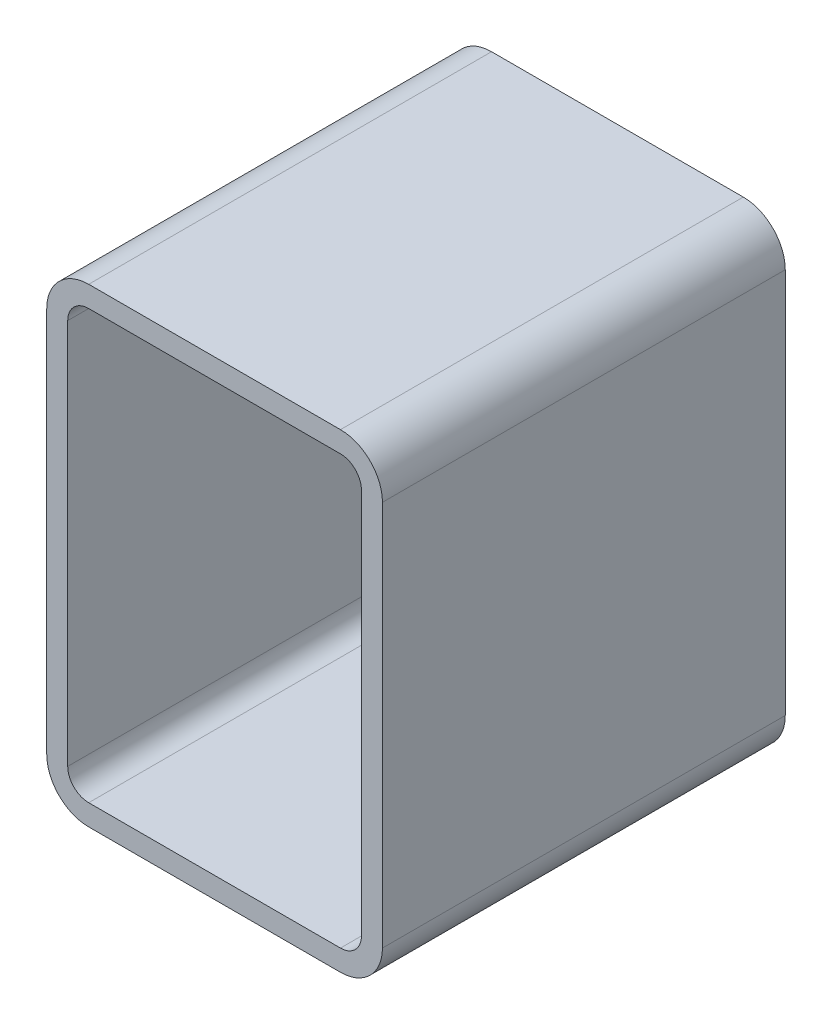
ISO-10303-21;
HEADER;
FILE_DESCRIPTION(('STEP AP214'),'2;1');
FILE_NAME('part.step','',(''),(''),'','','');
FILE_SCHEMA(('AUTOMOTIVE_DESIGN { 1 0 10303 214 1 1 1 1 }'));
ENDSEC;
DATA;
#1=APPLICATION_CONTEXT('core data for automotive mechanical design processes');
#2=APPLICATION_PROTOCOL_DEFINITION('international standard','automotive_design',2000,#1);
#3=PRODUCT_CONTEXT('',#1,'mechanical');
#4=PRODUCT('Part','Part','',(#3));
#5=PRODUCT_RELATED_PRODUCT_CATEGORY('part','',(#4));
#6=PRODUCT_DEFINITION_FORMATION('','',#4);
#7=PRODUCT_DEFINITION_CONTEXT('part definition',#1,'design');
#8=PRODUCT_DEFINITION('design','',#6,#7);
#9=PRODUCT_DEFINITION_SHAPE('','',#8);
#10=(LENGTH_UNIT() NAMED_UNIT(*) SI_UNIT(.MILLI.,.METRE.));
#11=(NAMED_UNIT(*) PLANE_ANGLE_UNIT() SI_UNIT($,.RADIAN.));
#12=(NAMED_UNIT(*) SI_UNIT($,.STERADIAN.) SOLID_ANGLE_UNIT());
#13=UNCERTAINTY_MEASURE_WITH_UNIT(LENGTH_MEASURE(1.E-05),#10,'distance_accuracy_value','');
#14=(GEOMETRIC_REPRESENTATION_CONTEXT(3) GLOBAL_UNCERTAINTY_ASSIGNED_CONTEXT((#13)) GLOBAL_UNIT_ASSIGNED_CONTEXT((#10,
#11,#12)) REPRESENTATION_CONTEXT('',''));
#15=CARTESIAN_POINT('',(0.,0.,0.));
#16=DIRECTION('',(0.,0.,1.));
#17=DIRECTION('',(1.,0.,0.));
#18=AXIS2_PLACEMENT_3D('',#15,#16,#17);
#19=CARTESIAN_POINT('',(34.4845794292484,325.678679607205,304.8));
#20=DIRECTION('',(0.,0.,1.));
#21=DIRECTION('',(1.,0.,0.));
#22=AXIS2_PLACEMENT_3D('',#19,#20,#21);
#23=PLANE('',#22);
#24=CARTESIAN_POINT('',(34.4845794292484,325.678679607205,304.8));
#25=DIRECTION('',(0.,0.,1.));
#26=DIRECTION('',(1.,0.,0.));
#27=AXIS2_PLACEMENT_3D('',#24,#25,#26);
#28=CIRCLE('',#27,31.75);
#29=CARTESIAN_POINT('',(34.4845794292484,357.428679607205,304.8));
#30=VERTEX_POINT('',#29);
#31=CARTESIAN_POINT('',(2.73457942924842,325.678679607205,304.8));
#32=VERTEX_POINT('',#31);
#33=EDGE_CURVE('E211',#30,#32,#28,.T.);
#34=ORIENTED_EDGE('',*,*,#33,.T.);
#35=DIRECTION('',(0.,-1.,0.));
#36=VECTOR('',#35,1.);
#37=CARTESIAN_POINT('',(2.73457942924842,33.5786796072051,304.8));
#38=LINE('',#37,#36);
#39=CARTESIAN_POINT('',(2.73457942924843,33.5786796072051,304.8));
#40=VERTEX_POINT('',#39);
#41=EDGE_CURVE('E214',#32,#40,#38,.T.);
#42=ORIENTED_EDGE('',*,*,#41,.T.);
#43=CARTESIAN_POINT('',(34.4845794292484,33.5786796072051,304.8));
#44=DIRECTION('',(0.,0.,1.));
#45=DIRECTION('',(1.,0.,0.));
#46=AXIS2_PLACEMENT_3D('',#43,#44,#45);
#47=CIRCLE('',#46,31.75);
#48=CARTESIAN_POINT('',(34.4845794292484,1.82867960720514,304.8));
#49=VERTEX_POINT('',#48);
#50=EDGE_CURVE('E217',#40,#49,#47,.T.);
#51=ORIENTED_EDGE('',*,*,#50,.T.);
#52=DIRECTION('',(1.,0.,0.));
#53=VECTOR('',#52,1.);
#54=CARTESIAN_POINT('',(224.984579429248,1.82867960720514,304.8));
#55=LINE('',#54,#53);
#56=CARTESIAN_POINT('',(224.984579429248,1.82867960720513,304.8));
#57=VERTEX_POINT('',#56);
#58=EDGE_CURVE('E219',#49,#57,#55,.T.);
#59=ORIENTED_EDGE('',*,*,#58,.T.);
#60=CARTESIAN_POINT('',(224.984579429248,33.5786796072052,304.8));
#61=DIRECTION('',(0.,0.,1.));
#62=DIRECTION('',(1.,0.,0.));
#63=AXIS2_PLACEMENT_3D('',#60,#61,#62);
#64=CIRCLE('',#63,31.75);
#65=CARTESIAN_POINT('',(256.734579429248,33.5786796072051,304.8));
#66=VERTEX_POINT('',#65);
#67=EDGE_CURVE('E221',#57,#66,#64,.T.);
#68=ORIENTED_EDGE('',*,*,#67,.T.);
#69=DIRECTION('',(0.,1.,0.));
#70=VECTOR('',#69,1.);
#71=CARTESIAN_POINT('',(256.734579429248,325.678679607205,304.8));
#72=LINE('',#71,#70);
#73=CARTESIAN_POINT('',(256.734579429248,325.678679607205,304.8));
#74=VERTEX_POINT('',#73);
#75=EDGE_CURVE('E223',#66,#74,#72,.T.);
#76=ORIENTED_EDGE('',*,*,#75,.T.);
#77=CARTESIAN_POINT('',(224.984579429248,325.678679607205,304.8));
#78=DIRECTION('',(0.,0.,1.));
#79=DIRECTION('',(1.,0.,0.));
#80=AXIS2_PLACEMENT_3D('',#77,#78,#79);
#81=CIRCLE('',#80,31.75);
#82=CARTESIAN_POINT('',(224.984579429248,357.428679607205,304.8));
#83=VERTEX_POINT('',#82);
#84=EDGE_CURVE('E225',#74,#83,#81,.T.);
#85=ORIENTED_EDGE('',*,*,#84,.T.);
#86=DIRECTION('',(-1.,0.,0.));
#87=VECTOR('',#86,1.);
#88=CARTESIAN_POINT('',(34.4845794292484,357.428679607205,304.8));
#89=LINE('',#88,#87);
#90=EDGE_CURVE('E227',#83,#30,#89,.T.);
#91=ORIENTED_EDGE('',*,*,#90,.T.);
#92=EDGE_LOOP('',(#34,#42,#51,#59,#68,#76,#85,#91));
#93=FACE_BOUND('',#92,.T.);
#94=DIRECTION('',(0.,-1.,0.));
#95=VECTOR('',#94,1.);
#96=CARTESIAN_POINT('',(18.6095794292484,33.5786796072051,304.8));
#97=LINE('',#96,#95);
#98=CARTESIAN_POINT('',(18.6095794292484,325.678679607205,304.8));
#99=VERTEX_POINT('',#98);
#100=CARTESIAN_POINT('',(18.6095794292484,33.5786796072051,304.8));
#101=VERTEX_POINT('',#100);
#102=EDGE_CURVE('E154',#99,#101,#97,.T.);
#103=ORIENTED_EDGE('',*,*,#102,.F.);
#104=CARTESIAN_POINT('',(34.4845794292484,325.678679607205,304.8));
#105=DIRECTION('',(0.,0.,1.));
#106=DIRECTION('',(1.,0.,0.));
#107=AXIS2_PLACEMENT_3D('',#104,#105,#106);
#108=CIRCLE('',#107,15.875);
#109=CARTESIAN_POINT('',(34.4845794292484,341.553679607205,304.8));
#110=VERTEX_POINT('',#109);
#111=EDGE_CURVE('E146',#110,#99,#108,.T.);
#112=ORIENTED_EDGE('',*,*,#111,.F.);
#113=DIRECTION('',(-1.,0.,0.));
#114=VECTOR('',#113,1.);
#115=CARTESIAN_POINT('',(34.4845794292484,341.553679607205,304.8));
#116=LINE('',#115,#114);
#117=CARTESIAN_POINT('',(224.984579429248,341.553679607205,304.8));
#118=VERTEX_POINT('',#117);
#119=EDGE_CURVE('E179',#118,#110,#116,.T.);
#120=ORIENTED_EDGE('',*,*,#119,.F.);
#121=CARTESIAN_POINT('',(224.984579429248,325.678679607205,304.8));
#122=DIRECTION('',(0.,0.,1.));
#123=DIRECTION('',(1.,0.,0.));
#124=AXIS2_PLACEMENT_3D('',#121,#122,#123);
#125=CIRCLE('',#124,15.875);
#126=CARTESIAN_POINT('',(240.859579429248,325.678679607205,304.8));
#127=VERTEX_POINT('',#126);
#128=EDGE_CURVE('E177',#127,#118,#125,.T.);
#129=ORIENTED_EDGE('',*,*,#128,.F.);
#130=DIRECTION('',(0.,1.,0.));
#131=VECTOR('',#130,1.);
#132=CARTESIAN_POINT('',(240.859579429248,325.678679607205,304.8));
#133=LINE('',#132,#131);
#134=CARTESIAN_POINT('',(240.859579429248,33.5786796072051,304.8));
#135=VERTEX_POINT('',#134);
#136=EDGE_CURVE('E175',#135,#127,#133,.T.);
#137=ORIENTED_EDGE('',*,*,#136,.F.);
#138=CARTESIAN_POINT('',(224.984579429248,33.5786796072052,304.8));
#139=DIRECTION('',(0.,0.,1.));
#140=DIRECTION('',(1.,0.,0.));
#141=AXIS2_PLACEMENT_3D('',#138,#139,#140);
#142=CIRCLE('',#141,15.875);
#143=CARTESIAN_POINT('',(224.984579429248,17.7036796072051,304.8));
#144=VERTEX_POINT('',#143);
#145=EDGE_CURVE('E173',#144,#135,#142,.T.);
#146=ORIENTED_EDGE('',*,*,#145,.F.);
#147=DIRECTION('',(1.,0.,0.));
#148=VECTOR('',#147,1.);
#149=CARTESIAN_POINT('',(224.984579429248,17.7036796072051,304.8));
#150=LINE('',#149,#148);
#151=CARTESIAN_POINT('',(34.4845794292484,17.7036796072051,304.8));
#152=VERTEX_POINT('',#151);
#153=EDGE_CURVE('E169',#152,#144,#150,.T.);
#154=ORIENTED_EDGE('',*,*,#153,.F.);
#155=CARTESIAN_POINT('',(34.4845794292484,33.5786796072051,304.8));
#156=DIRECTION('',(0.,0.,1.));
#157=DIRECTION('',(1.,0.,0.));
#158=AXIS2_PLACEMENT_3D('',#155,#156,#157);
#159=CIRCLE('',#158,15.875);
#160=EDGE_CURVE('E167',#101,#152,#159,.T.);
#161=ORIENTED_EDGE('',*,*,#160,.F.);
#162=EDGE_LOOP('',(#103,#112,#120,#129,#137,#146,#154,#161));
#163=FACE_BOUND('',#162,.T.);
#164=ADVANCED_FACE('F33',(#93,#163),#23,.T.);
#165=CARTESIAN_POINT('',(34.4845794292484,325.678679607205,0.));
#166=DIRECTION('',(0.,0.,1.));
#167=DIRECTION('',(1.,0.,0.));
#168=AXIS2_PLACEMENT_3D('',#165,#166,#167);
#169=PLANE('',#168);
#170=CARTESIAN_POINT('',(34.4845794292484,325.678679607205,0.));
#171=DIRECTION('',(0.,0.,1.));
#172=DIRECTION('',(1.,0.,0.));
#173=AXIS2_PLACEMENT_3D('',#170,#171,#172);
#174=CIRCLE('',#173,31.75);
#175=CARTESIAN_POINT('',(34.4845794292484,357.428679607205,0.));
#176=VERTEX_POINT('',#175);
#177=CARTESIAN_POINT('',(2.73457942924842,325.678679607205,0.));
#178=VERTEX_POINT('',#177);
#179=EDGE_CURVE('E162',#176,#178,#174,.T.);
#180=ORIENTED_EDGE('',*,*,#179,.F.);
#181=DIRECTION('',(-1.,0.,0.));
#182=VECTOR('',#181,1.);
#183=CARTESIAN_POINT('',(34.4845794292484,357.428679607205,0.));
#184=LINE('',#183,#182);
#185=CARTESIAN_POINT('',(224.984579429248,357.428679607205,0.));
#186=VERTEX_POINT('',#185);
#187=EDGE_CURVE('E215',#186,#176,#184,.T.);
#188=ORIENTED_EDGE('',*,*,#187,.F.);
#189=CARTESIAN_POINT('',(224.984579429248,325.678679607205,0.));
#190=DIRECTION('',(0.,0.,1.));
#191=DIRECTION('',(1.,0.,0.));
#192=AXIS2_PLACEMENT_3D('',#189,#190,#191);
#193=CIRCLE('',#192,31.75);
#194=CARTESIAN_POINT('',(256.734579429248,325.678679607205,0.));
#195=VERTEX_POINT('',#194);
#196=EDGE_CURVE('E242',#195,#186,#193,.T.);
#197=ORIENTED_EDGE('',*,*,#196,.F.);
#198=DIRECTION('',(0.,1.,0.));
#199=VECTOR('',#198,1.);
#200=CARTESIAN_POINT('',(256.734579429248,325.678679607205,0.));
#201=LINE('',#200,#199);
#202=CARTESIAN_POINT('',(256.734579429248,33.5786796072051,0.));
#203=VERTEX_POINT('',#202);
#204=EDGE_CURVE('E240',#203,#195,#201,.T.);
#205=ORIENTED_EDGE('',*,*,#204,.F.);
#206=CARTESIAN_POINT('',(224.984579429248,33.5786796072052,0.));
#207=DIRECTION('',(0.,0.,1.));
#208=DIRECTION('',(1.,0.,0.));
#209=AXIS2_PLACEMENT_3D('',#206,#207,#208);
#210=CIRCLE('',#209,31.75);
#211=CARTESIAN_POINT('',(224.984579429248,1.82867960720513,0.));
#212=VERTEX_POINT('',#211);
#213=EDGE_CURVE('E238',#212,#203,#210,.T.);
#214=ORIENTED_EDGE('',*,*,#213,.F.);
#215=DIRECTION('',(1.,0.,0.));
#216=VECTOR('',#215,1.);
#217=CARTESIAN_POINT('',(224.984579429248,1.82867960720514,0.));
#218=LINE('',#217,#216);
#219=CARTESIAN_POINT('',(34.4845794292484,1.82867960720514,0.));
#220=VERTEX_POINT('',#219);
#221=EDGE_CURVE('E236',#220,#212,#218,.T.);
#222=ORIENTED_EDGE('',*,*,#221,.F.);
#223=CARTESIAN_POINT('',(34.4845794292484,33.5786796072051,0.));
#224=DIRECTION('',(0.,0.,1.));
#225=DIRECTION('',(1.,0.,0.));
#226=AXIS2_PLACEMENT_3D('',#223,#224,#225);
#227=CIRCLE('',#226,31.75);
#228=CARTESIAN_POINT('',(2.73457942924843,33.5786796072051,0.));
#229=VERTEX_POINT('',#228);
#230=EDGE_CURVE('E234',#229,#220,#227,.T.);
#231=ORIENTED_EDGE('',*,*,#230,.F.);
#232=DIRECTION('',(0.,-1.,0.));
#233=VECTOR('',#232,1.);
#234=CARTESIAN_POINT('',(2.73457942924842,33.5786796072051,0.));
#235=LINE('',#234,#233);
#236=EDGE_CURVE('E232',#178,#229,#235,.T.);
#237=ORIENTED_EDGE('',*,*,#236,.F.);
#238=EDGE_LOOP('',(#180,#188,#197,#205,#214,#222,#231,#237));
#239=FACE_BOUND('',#238,.T.);
#240=CARTESIAN_POINT('',(34.4845794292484,325.678679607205,0.));
#241=DIRECTION('',(0.,0.,1.));
#242=DIRECTION('',(1.,0.,0.));
#243=AXIS2_PLACEMENT_3D('',#240,#241,#242);
#244=CIRCLE('',#243,15.875);
#245=CARTESIAN_POINT('',(34.4845794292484,341.553679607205,0.));
#246=VERTEX_POINT('',#245);
#247=CARTESIAN_POINT('',(18.6095794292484,325.678679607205,0.));
#248=VERTEX_POINT('',#247);
#249=EDGE_CURVE('E56',#246,#248,#244,.T.);
#250=ORIENTED_EDGE('',*,*,#249,.T.);
#251=DIRECTION('',(0.,-1.,0.));
#252=VECTOR('',#251,1.);
#253=CARTESIAN_POINT('',(18.6095794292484,33.5786796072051,0.));
#254=LINE('',#253,#252);
#255=CARTESIAN_POINT('',(18.6095794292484,33.5786796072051,0.));
#256=VERTEX_POINT('',#255);
#257=EDGE_CURVE('E161',#248,#256,#254,.T.);
#258=ORIENTED_EDGE('',*,*,#257,.T.);
#259=CARTESIAN_POINT('',(34.4845794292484,33.5786796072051,0.));
#260=DIRECTION('',(0.,0.,1.));
#261=DIRECTION('',(1.,0.,0.));
#262=AXIS2_PLACEMENT_3D('',#259,#260,#261);
#263=CIRCLE('',#262,15.875);
#264=CARTESIAN_POINT('',(34.4845794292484,17.7036796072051,0.));
#265=VERTEX_POINT('',#264);
#266=EDGE_CURVE('E183',#256,#265,#263,.T.);
#267=ORIENTED_EDGE('',*,*,#266,.T.);
#268=DIRECTION('',(1.,0.,0.));
#269=VECTOR('',#268,1.);
#270=CARTESIAN_POINT('',(224.984579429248,17.7036796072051,0.));
#271=LINE('',#270,#269);
#272=CARTESIAN_POINT('',(224.984579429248,17.7036796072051,0.));
#273=VERTEX_POINT('',#272);
#274=EDGE_CURVE('E186',#265,#273,#271,.T.);
#275=ORIENTED_EDGE('',*,*,#274,.T.);
#276=CARTESIAN_POINT('',(224.984579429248,33.5786796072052,0.));
#277=DIRECTION('',(0.,0.,1.));
#278=DIRECTION('',(1.,0.,0.));
#279=AXIS2_PLACEMENT_3D('',#276,#277,#278);
#280=CIRCLE('',#279,15.875);
#281=CARTESIAN_POINT('',(240.859579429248,33.5786796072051,0.));
#282=VERTEX_POINT('',#281);
#283=EDGE_CURVE('E189',#273,#282,#280,.T.);
#284=ORIENTED_EDGE('',*,*,#283,.T.);
#285=DIRECTION('',(0.,1.,0.));
#286=VECTOR('',#285,1.);
#287=CARTESIAN_POINT('',(240.859579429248,325.678679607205,0.));
#288=LINE('',#287,#286);
#289=CARTESIAN_POINT('',(240.859579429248,325.678679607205,0.));
#290=VERTEX_POINT('',#289);
#291=EDGE_CURVE('E192',#282,#290,#288,.T.);
#292=ORIENTED_EDGE('',*,*,#291,.T.);
#293=CARTESIAN_POINT('',(224.984579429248,325.678679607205,0.));
#294=DIRECTION('',(0.,0.,1.));
#295=DIRECTION('',(1.,0.,0.));
#296=AXIS2_PLACEMENT_3D('',#293,#294,#295);
#297=CIRCLE('',#296,15.875);
#298=CARTESIAN_POINT('',(224.984579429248,341.553679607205,0.));
#299=VERTEX_POINT('',#298);
#300=EDGE_CURVE('E195',#290,#299,#297,.T.);
#301=ORIENTED_EDGE('',*,*,#300,.T.);
#302=DIRECTION('',(-1.,0.,0.));
#303=VECTOR('',#302,1.);
#304=CARTESIAN_POINT('',(34.4845794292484,341.553679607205,0.));
#305=LINE('',#304,#303);
#306=EDGE_CURVE('E155',#299,#246,#305,.T.);
#307=ORIENTED_EDGE('',*,*,#306,.T.);
#308=EDGE_LOOP('',(#250,#258,#267,#275,#284,#292,#301,#307));
#309=FACE_BOUND('',#308,.T.);
#310=ADVANCED_FACE('F272',(#239,#309),#169,.F.);
#311=CARTESIAN_POINT('',(34.4845794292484,325.678679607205,304.8));
#312=DIRECTION('',(0.,0.,-1.));
#313=DIRECTION('',(-1.,0.,0.));
#314=AXIS2_PLACEMENT_3D('',#311,#312,#313);
#315=CYLINDRICAL_SURFACE('',#314,31.75);
#316=ORIENTED_EDGE('',*,*,#179,.T.);
#317=DIRECTION('',(0.,0.,-1.));
#318=VECTOR('',#317,1.);
#319=CARTESIAN_POINT('',(2.73457942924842,325.678679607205,304.8));
#320=LINE('',#319,#318);
#321=EDGE_CURVE('E11',#32,#178,#320,.T.);
#322=ORIENTED_EDGE('',*,*,#321,.F.);
#323=ORIENTED_EDGE('',*,*,#33,.F.);
#324=DIRECTION('',(0.,0.,-1.));
#325=VECTOR('',#324,1.);
#326=CARTESIAN_POINT('',(34.4845794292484,357.428679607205,304.8));
#327=LINE('',#326,#325);
#328=EDGE_CURVE('E229',#30,#176,#327,.T.);
#329=ORIENTED_EDGE('',*,*,#328,.T.);
#330=EDGE_LOOP('',(#316,#322,#323,#329));
#331=FACE_BOUND('',#330,.T.);
#332=ADVANCED_FACE('F35',(#331),#315,.T.);
#333=CARTESIAN_POINT('',(2.73457942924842,33.5786796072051,304.8));
#334=DIRECTION('',(1.,0.,0.));
#335=DIRECTION('',(0.,0.,-1.));
#336=AXIS2_PLACEMENT_3D('',#333,#334,#335);
#337=PLANE('',#336);
#338=ORIENTED_EDGE('',*,*,#236,.T.);
#339=DIRECTION('',(0.,0.,-1.));
#340=VECTOR('',#339,1.);
#341=CARTESIAN_POINT('',(2.73457942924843,33.5786796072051,304.8));
#342=LINE('',#341,#340);
#343=EDGE_CURVE('E41',#40,#229,#342,.T.);
#344=ORIENTED_EDGE('',*,*,#343,.F.);
#345=ORIENTED_EDGE('',*,*,#41,.F.);
#346=ORIENTED_EDGE('',*,*,#321,.T.);
#347=EDGE_LOOP('',(#338,#344,#345,#346));
#348=FACE_BOUND('',#347,.T.);
#349=ADVANCED_FACE('F289',(#348),#337,.F.);
#350=CARTESIAN_POINT('',(34.4845794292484,33.5786796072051,304.8));
#351=DIRECTION('',(0.,0.,-1.));
#352=DIRECTION('',(-1.,0.,0.));
#353=AXIS2_PLACEMENT_3D('',#350,#351,#352);
#354=CYLINDRICAL_SURFACE('',#353,31.75);
#355=ORIENTED_EDGE('',*,*,#230,.T.);
#356=DIRECTION('',(0.,0.,-1.));
#357=VECTOR('',#356,1.);
#358=CARTESIAN_POINT('',(34.4845794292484,1.82867960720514,304.8));
#359=LINE('',#358,#357);
#360=EDGE_CURVE('E259',#49,#220,#359,.T.);
#361=ORIENTED_EDGE('',*,*,#360,.F.);
#362=ORIENTED_EDGE('',*,*,#50,.F.);
#363=ORIENTED_EDGE('',*,*,#343,.T.);
#364=EDGE_LOOP('',(#355,#361,#362,#363));
#365=FACE_BOUND('',#364,.T.);
#366=ADVANCED_FACE('F266',(#365),#354,.T.);
#367=CARTESIAN_POINT('',(224.984579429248,1.82867960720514,304.8));
#368=DIRECTION('',(0.,1.,0.));
#369=DIRECTION('',(0.,0.,1.));
#370=AXIS2_PLACEMENT_3D('',#367,#368,#369);
#371=PLANE('',#370);
#372=ORIENTED_EDGE('',*,*,#221,.T.);
#373=DIRECTION('',(0.,0.,-1.));
#374=VECTOR('',#373,1.);
#375=CARTESIAN_POINT('',(224.984579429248,1.82867960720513,304.8));
#376=LINE('',#375,#374);
#377=EDGE_CURVE('E256',#57,#212,#376,.T.);
#378=ORIENTED_EDGE('',*,*,#377,.F.);
#379=ORIENTED_EDGE('',*,*,#58,.F.);
#380=ORIENTED_EDGE('',*,*,#360,.T.);
#381=EDGE_LOOP('',(#372,#378,#379,#380));
#382=FACE_BOUND('',#381,.T.);
#383=ADVANCED_FACE('F278',(#382),#371,.F.);
#384=CARTESIAN_POINT('',(224.984579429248,33.5786796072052,304.8));
#385=DIRECTION('',(0.,0.,-1.));
#386=DIRECTION('',(-1.,0.,0.));
#387=AXIS2_PLACEMENT_3D('',#384,#385,#386);
#388=CYLINDRICAL_SURFACE('',#387,31.75);
#389=ORIENTED_EDGE('',*,*,#213,.T.);
#390=DIRECTION('',(0.,0.,-1.));
#391=VECTOR('',#390,1.);
#392=CARTESIAN_POINT('',(256.734579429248,33.5786796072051,304.8));
#393=LINE('',#392,#391);
#394=EDGE_CURVE('E253',#66,#203,#393,.T.);
#395=ORIENTED_EDGE('',*,*,#394,.F.);
#396=ORIENTED_EDGE('',*,*,#67,.F.);
#397=ORIENTED_EDGE('',*,*,#377,.T.);
#398=EDGE_LOOP('',(#389,#395,#396,#397));
#399=FACE_BOUND('',#398,.T.);
#400=ADVANCED_FACE('F282',(#399),#388,.T.);
#401=CARTESIAN_POINT('',(256.734579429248,325.678679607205,304.8));
#402=DIRECTION('',(-1.,0.,0.));
#403=DIRECTION('',(0.,0.,1.));
#404=AXIS2_PLACEMENT_3D('',#401,#402,#403);
#405=PLANE('',#404);
#406=ORIENTED_EDGE('',*,*,#204,.T.);
#407=DIRECTION('',(0.,0.,-1.));
#408=VECTOR('',#407,1.);
#409=CARTESIAN_POINT('',(256.734579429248,325.678679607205,304.8));
#410=LINE('',#409,#408);
#411=EDGE_CURVE('E250',#74,#195,#410,.T.);
#412=ORIENTED_EDGE('',*,*,#411,.F.);
#413=ORIENTED_EDGE('',*,*,#75,.F.);
#414=ORIENTED_EDGE('',*,*,#394,.T.);
#415=EDGE_LOOP('',(#406,#412,#413,#414));
#416=FACE_BOUND('',#415,.T.);
#417=ADVANCED_FACE('F302',(#416),#405,.F.);
#418=CARTESIAN_POINT('',(224.984579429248,325.678679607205,304.8));
#419=DIRECTION('',(0.,0.,-1.));
#420=DIRECTION('',(-1.,0.,0.));
#421=AXIS2_PLACEMENT_3D('',#418,#419,#420);
#422=CYLINDRICAL_SURFACE('',#421,31.75);
#423=ORIENTED_EDGE('',*,*,#196,.T.);
#424=DIRECTION('',(0.,0.,-1.));
#425=VECTOR('',#424,1.);
#426=CARTESIAN_POINT('',(224.984579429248,357.428679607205,304.8));
#427=LINE('',#426,#425);
#428=EDGE_CURVE('E247',#83,#186,#427,.T.);
#429=ORIENTED_EDGE('',*,*,#428,.F.);
#430=ORIENTED_EDGE('',*,*,#84,.F.);
#431=ORIENTED_EDGE('',*,*,#411,.T.);
#432=EDGE_LOOP('',(#423,#429,#430,#431));
#433=FACE_BOUND('',#432,.T.);
#434=ADVANCED_FACE('F300',(#433),#422,.T.);
#435=CARTESIAN_POINT('',(34.4845794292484,357.428679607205,304.8));
#436=DIRECTION('',(0.,-1.,0.));
#437=DIRECTION('',(0.,0.,-1.));
#438=AXIS2_PLACEMENT_3D('',#435,#436,#437);
#439=PLANE('',#438);
#440=ORIENTED_EDGE('',*,*,#187,.T.);
#441=ORIENTED_EDGE('',*,*,#328,.F.);
#442=ORIENTED_EDGE('',*,*,#90,.F.);
#443=ORIENTED_EDGE('',*,*,#428,.T.);
#444=EDGE_LOOP('',(#440,#441,#442,#443));
#445=FACE_BOUND('',#444,.T.);
#446=ADVANCED_FACE('F295',(#445),#439,.F.);
#447=CARTESIAN_POINT('',(34.4845794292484,325.678679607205,304.8));
#448=DIRECTION('',(0.,0.,-1.));
#449=DIRECTION('',(-1.,0.,0.));
#450=AXIS2_PLACEMENT_3D('',#447,#448,#449);
#451=CYLINDRICAL_SURFACE('',#450,15.875);
#452=ORIENTED_EDGE('',*,*,#249,.F.);
#453=DIRECTION('',(0.,0.,-1.));
#454=VECTOR('',#453,1.);
#455=CARTESIAN_POINT('',(34.4845794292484,341.553679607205,304.8));
#456=LINE('',#455,#454);
#457=EDGE_CURVE('E150',#110,#246,#456,.T.);
#458=ORIENTED_EDGE('',*,*,#457,.F.);
#459=ORIENTED_EDGE('',*,*,#111,.T.);
#460=DIRECTION('',(0.,0.,-1.));
#461=VECTOR('',#460,1.);
#462=CARTESIAN_POINT('',(18.6095794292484,325.678679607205,304.8));
#463=LINE('',#462,#461);
#464=EDGE_CURVE('E149',#99,#248,#463,.T.);
#465=ORIENTED_EDGE('',*,*,#464,.T.);
#466=EDGE_LOOP('',(#452,#458,#459,#465));
#467=FACE_BOUND('',#466,.T.);
#468=ADVANCED_FACE('F148',(#467),#451,.F.);
#469=CARTESIAN_POINT('',(18.6095794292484,33.5786796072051,304.8));
#470=DIRECTION('',(1.,0.,0.));
#471=DIRECTION('',(0.,0.,-1.));
#472=AXIS2_PLACEMENT_3D('',#469,#470,#471);
#473=PLANE('',#472);
#474=ORIENTED_EDGE('',*,*,#257,.F.);
#475=ORIENTED_EDGE('',*,*,#464,.F.);
#476=ORIENTED_EDGE('',*,*,#102,.T.);
#477=DIRECTION('',(0.,0.,-1.));
#478=VECTOR('',#477,1.);
#479=CARTESIAN_POINT('',(18.6095794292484,33.5786796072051,304.8));
#480=LINE('',#479,#478);
#481=EDGE_CURVE('E163',#101,#256,#480,.T.);
#482=ORIENTED_EDGE('',*,*,#481,.T.);
#483=EDGE_LOOP('',(#474,#475,#476,#482));
#484=FACE_BOUND('',#483,.T.);
#485=ADVANCED_FACE('F158',(#484),#473,.T.);
#486=CARTESIAN_POINT('',(34.4845794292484,33.5786796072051,304.8));
#487=DIRECTION('',(0.,0.,-1.));
#488=DIRECTION('',(-1.,0.,0.));
#489=AXIS2_PLACEMENT_3D('',#486,#487,#488);
#490=CYLINDRICAL_SURFACE('',#489,15.875);
#491=ORIENTED_EDGE('',*,*,#266,.F.);
#492=ORIENTED_EDGE('',*,*,#481,.F.);
#493=ORIENTED_EDGE('',*,*,#160,.T.);
#494=DIRECTION('',(0.,0.,-1.));
#495=VECTOR('',#494,1.);
#496=CARTESIAN_POINT('',(34.4845794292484,17.7036796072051,304.8));
#497=LINE('',#496,#495);
#498=EDGE_CURVE('E208',#152,#265,#497,.T.);
#499=ORIENTED_EDGE('',*,*,#498,.T.);
#500=EDGE_LOOP('',(#491,#492,#493,#499));
#501=FACE_BOUND('',#500,.T.);
#502=ADVANCED_FACE('F327',(#501),#490,.F.);
#503=CARTESIAN_POINT('',(224.984579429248,17.7036796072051,304.8));
#504=DIRECTION('',(0.,1.,0.));
#505=DIRECTION('',(0.,0.,1.));
#506=AXIS2_PLACEMENT_3D('',#503,#504,#505);
#507=PLANE('',#506);
#508=ORIENTED_EDGE('',*,*,#274,.F.);
#509=ORIENTED_EDGE('',*,*,#498,.F.);
#510=ORIENTED_EDGE('',*,*,#153,.T.);
#511=DIRECTION('',(0.,0.,-1.));
#512=VECTOR('',#511,1.);
#513=CARTESIAN_POINT('',(224.984579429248,17.7036796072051,304.8));
#514=LINE('',#513,#512);
#515=EDGE_CURVE('E206',#144,#273,#514,.T.);
#516=ORIENTED_EDGE('',*,*,#515,.T.);
#517=EDGE_LOOP('',(#508,#509,#510,#516));
#518=FACE_BOUND('',#517,.T.);
#519=ADVANCED_FACE('F331',(#518),#507,.T.);
#520=CARTESIAN_POINT('',(224.984579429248,33.5786796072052,304.8));
#521=DIRECTION('',(0.,0.,-1.));
#522=DIRECTION('',(-1.,0.,0.));
#523=AXIS2_PLACEMENT_3D('',#520,#521,#522);
#524=CYLINDRICAL_SURFACE('',#523,15.875);
#525=ORIENTED_EDGE('',*,*,#283,.F.);
#526=ORIENTED_EDGE('',*,*,#515,.F.);
#527=ORIENTED_EDGE('',*,*,#145,.T.);
#528=DIRECTION('',(0.,0.,-1.));
#529=VECTOR('',#528,1.);
#530=CARTESIAN_POINT('',(240.859579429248,33.5786796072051,304.8));
#531=LINE('',#530,#529);
#532=EDGE_CURVE('E204',#135,#282,#531,.T.);
#533=ORIENTED_EDGE('',*,*,#532,.T.);
#534=EDGE_LOOP('',(#525,#526,#527,#533));
#535=FACE_BOUND('',#534,.T.);
#536=ADVANCED_FACE('F337',(#535),#524,.F.);
#537=CARTESIAN_POINT('',(240.859579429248,325.678679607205,304.8));
#538=DIRECTION('',(-1.,0.,0.));
#539=DIRECTION('',(0.,0.,1.));
#540=AXIS2_PLACEMENT_3D('',#537,#538,#539);
#541=PLANE('',#540);
#542=ORIENTED_EDGE('',*,*,#291,.F.);
#543=ORIENTED_EDGE('',*,*,#532,.F.);
#544=ORIENTED_EDGE('',*,*,#136,.T.);
#545=DIRECTION('',(0.,0.,-1.));
#546=VECTOR('',#545,1.);
#547=CARTESIAN_POINT('',(240.859579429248,325.678679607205,304.8));
#548=LINE('',#547,#546);
#549=EDGE_CURVE('E202',#127,#290,#548,.T.);
#550=ORIENTED_EDGE('',*,*,#549,.T.);
#551=EDGE_LOOP('',(#542,#543,#544,#550));
#552=FACE_BOUND('',#551,.T.);
#553=ADVANCED_FACE('F341',(#552),#541,.T.);
#554=CARTESIAN_POINT('',(224.984579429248,325.678679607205,304.8));
#555=DIRECTION('',(0.,0.,-1.));
#556=DIRECTION('',(-1.,0.,0.));
#557=AXIS2_PLACEMENT_3D('',#554,#555,#556);
#558=CYLINDRICAL_SURFACE('',#557,15.875);
#559=ORIENTED_EDGE('',*,*,#300,.F.);
#560=ORIENTED_EDGE('',*,*,#549,.F.);
#561=ORIENTED_EDGE('',*,*,#128,.T.);
#562=DIRECTION('',(0.,0.,-1.));
#563=VECTOR('',#562,1.);
#564=CARTESIAN_POINT('',(224.984579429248,341.553679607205,304.8));
#565=LINE('',#564,#563);
#566=EDGE_CURVE('E48',#118,#299,#565,.T.);
#567=ORIENTED_EDGE('',*,*,#566,.T.);
#568=EDGE_LOOP('',(#559,#560,#561,#567));
#569=FACE_BOUND('',#568,.T.);
#570=ADVANCED_FACE('F345',(#569),#558,.F.);
#571=CARTESIAN_POINT('',(34.4845794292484,341.553679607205,304.8));
#572=DIRECTION('',(0.,-1.,0.));
#573=DIRECTION('',(0.,0.,-1.));
#574=AXIS2_PLACEMENT_3D('',#571,#572,#573);
#575=PLANE('',#574);
#576=ORIENTED_EDGE('',*,*,#306,.F.);
#577=ORIENTED_EDGE('',*,*,#566,.F.);
#578=ORIENTED_EDGE('',*,*,#119,.T.);
#579=ORIENTED_EDGE('',*,*,#457,.T.);
#580=EDGE_LOOP('',(#576,#577,#578,#579));
#581=FACE_BOUND('',#580,.T.);
#582=ADVANCED_FACE('F349',(#581),#575,.T.);
#583=CLOSED_SHELL('',(#164,#310,#332,#349,#366,#383,#400,#417,#434,#446,#468,#485,#502,#519,
#536,#553,#570,#582));
#584=MANIFOLD_SOLID_BREP('B2',#583);
#585=ADVANCED_BREP_SHAPE_REPRESENTATION('',(#18,#584),#14);
#586=SHAPE_DEFINITION_REPRESENTATION(#9,#585);
ENDSEC;
END-ISO-10303-21;
